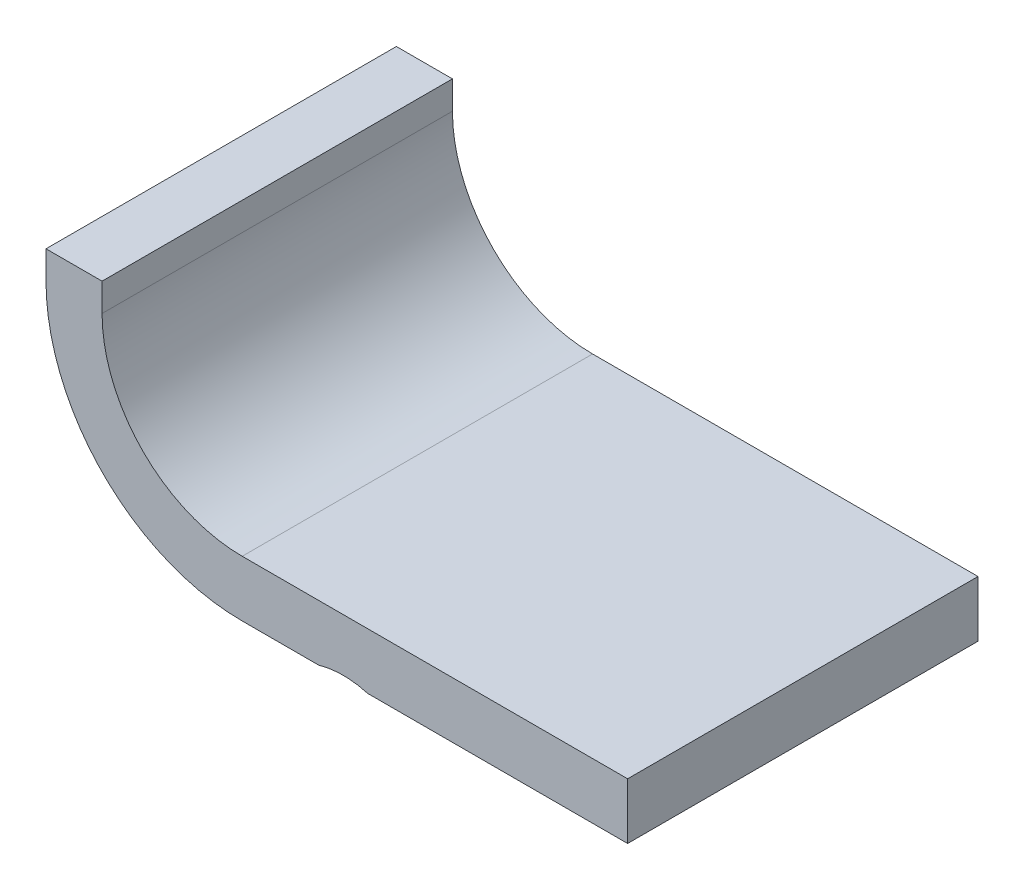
ISO-10303-21;
HEADER;
FILE_DESCRIPTION(('STEP AP214'),'2;1');
FILE_NAME('part.step','',(''),(''),'','','');
FILE_SCHEMA(('AUTOMOTIVE_DESIGN { 1 0 10303 214 1 1 1 1 }'));
ENDSEC;
DATA;
#1=APPLICATION_CONTEXT('core data for automotive mechanical design processes');
#2=APPLICATION_PROTOCOL_DEFINITION('international standard','automotive_design',2000,#1);
#3=PRODUCT_CONTEXT('',#1,'mechanical');
#4=PRODUCT('Part','Part','',(#3));
#5=PRODUCT_RELATED_PRODUCT_CATEGORY('part','',(#4));
#6=PRODUCT_DEFINITION_FORMATION('','',#4);
#7=PRODUCT_DEFINITION_CONTEXT('part definition',#1,'design');
#8=PRODUCT_DEFINITION('design','',#6,#7);
#9=PRODUCT_DEFINITION_SHAPE('','',#8);
#10=(LENGTH_UNIT() NAMED_UNIT(*) SI_UNIT(.MILLI.,.METRE.));
#11=(NAMED_UNIT(*) PLANE_ANGLE_UNIT() SI_UNIT($,.RADIAN.));
#12=(NAMED_UNIT(*) SI_UNIT($,.STERADIAN.) SOLID_ANGLE_UNIT());
#13=UNCERTAINTY_MEASURE_WITH_UNIT(LENGTH_MEASURE(1.E-05),#10,'distance_accuracy_value','');
#14=(GEOMETRIC_REPRESENTATION_CONTEXT(3) GLOBAL_UNCERTAINTY_ASSIGNED_CONTEXT((#13)) GLOBAL_UNIT_ASSIGNED_CONTEXT((#10,
#11,#12)) REPRESENTATION_CONTEXT('',''));
#15=CARTESIAN_POINT('',(0.,0.,0.));
#16=DIRECTION('',(0.,0.,1.));
#17=DIRECTION('',(1.,0.,0.));
#18=AXIS2_PLACEMENT_3D('',#15,#16,#17);
#19=CARTESIAN_POINT('',(0.,0.,50.));
#20=DIRECTION('',(0.,1.,0.));
#21=DIRECTION('',(-1.,0.,0.));
#22=AXIS2_PLACEMENT_3D('',#19,#20,#21);
#23=PLANE('',#22);
#24=DIRECTION('',(1.,0.,0.));
#25=VECTOR('',#24,1.);
#26=CARTESIAN_POINT('',(0.,0.,50.));
#27=LINE('',#26,#25);
#28=CARTESIAN_POINT('',(-37.1,0.,50.));
#29=VERTEX_POINT('',#28);
#30=CARTESIAN_POINT('',(0.,0.,50.));
#31=VERTEX_POINT('',#30);
#32=EDGE_CURVE('E54',#29,#31,#27,.T.);
#33=ORIENTED_EDGE('',*,*,#32,.F.);
#34=DIRECTION('',(0.,0.,-1.));
#35=VECTOR('',#34,1.);
#36=CARTESIAN_POINT('',(-37.1,0.,50.));
#37=LINE('',#36,#35);
#38=CARTESIAN_POINT('',(-37.1,0.,0.));
#39=VERTEX_POINT('',#38);
#40=EDGE_CURVE('E110',#29,#39,#37,.T.);
#41=ORIENTED_EDGE('',*,*,#40,.T.);
#42=DIRECTION('',(1.,0.,0.));
#43=VECTOR('',#42,1.);
#44=CARTESIAN_POINT('',(0.,0.,0.));
#45=LINE('',#44,#43);
#46=CARTESIAN_POINT('',(0.,0.,0.));
#47=VERTEX_POINT('',#46);
#48=EDGE_CURVE('E176',#39,#47,#45,.T.);
#49=ORIENTED_EDGE('',*,*,#48,.T.);
#50=DIRECTION('',(0.,0.,-1.));
#51=VECTOR('',#50,1.);
#52=CARTESIAN_POINT('',(0.,0.,50.));
#53=LINE('',#52,#51);
#54=EDGE_CURVE('E127',#31,#47,#53,.T.);
#55=ORIENTED_EDGE('',*,*,#54,.F.);
#56=EDGE_LOOP('',(#33,#41,#49,#55));
#57=FACE_BOUND('',#56,.T.);
#58=ADVANCED_FACE('F31',(#57),#23,.F.);
#59=CARTESIAN_POINT('',(0.,8.,50.));
#60=DIRECTION('',(-1.,0.,0.));
#61=DIRECTION('',(0.,0.,1.));
#62=AXIS2_PLACEMENT_3D('',#59,#60,#61);
#63=PLANE('',#62);
#64=DIRECTION('',(0.,1.,0.));
#65=VECTOR('',#64,1.);
#66=CARTESIAN_POINT('',(0.,8.,0.));
#67=LINE('',#66,#65);
#68=CARTESIAN_POINT('',(0.,8.,0.));
#69=VERTEX_POINT('',#68);
#70=EDGE_CURVE('E167',#47,#69,#67,.T.);
#71=ORIENTED_EDGE('',*,*,#70,.T.);
#72=DIRECTION('',(0.,0.,-1.));
#73=VECTOR('',#72,1.);
#74=CARTESIAN_POINT('',(0.,8.,50.));
#75=LINE('',#74,#73);
#76=CARTESIAN_POINT('',(0.,8.,50.));
#77=VERTEX_POINT('',#76);
#78=EDGE_CURVE('E11',#77,#69,#75,.T.);
#79=ORIENTED_EDGE('',*,*,#78,.F.);
#80=DIRECTION('',(0.,1.,0.));
#81=VECTOR('',#80,1.);
#82=CARTESIAN_POINT('',(0.,8.,50.));
#83=LINE('',#82,#81);
#84=EDGE_CURVE('E178',#31,#77,#83,.T.);
#85=ORIENTED_EDGE('',*,*,#84,.F.);
#86=ORIENTED_EDGE('',*,*,#54,.T.);
#87=EDGE_LOOP('',(#71,#79,#85,#86));
#88=FACE_BOUND('',#87,.T.);
#89=ADVANCED_FACE('F33',(#88),#63,.F.);
#90=CARTESIAN_POINT('',(0.,8.,50.));
#91=DIRECTION('',(0.,-1.,0.));
#92=DIRECTION('',(0.,0.,-1.));
#93=AXIS2_PLACEMENT_3D('',#90,#91,#92);
#94=PLANE('',#93);
#95=DIRECTION('',(-1.,0.,0.));
#96=VECTOR('',#95,1.);
#97=CARTESIAN_POINT('',(0.,8.,0.));
#98=LINE('',#97,#96);
#99=CARTESIAN_POINT('',(-55.,8.,0.));
#100=VERTEX_POINT('',#99);
#101=EDGE_CURVE('E161',#69,#100,#98,.T.);
#102=ORIENTED_EDGE('',*,*,#101,.T.);
#103=DIRECTION('',(0.,0.,-1.));
#104=VECTOR('',#103,1.);
#105=CARTESIAN_POINT('',(-55.,8.,50.));
#106=LINE('',#105,#104);
#107=CARTESIAN_POINT('',(-55.,8.,50.));
#108=VERTEX_POINT('',#107);
#109=EDGE_CURVE('E39',#108,#100,#106,.T.);
#110=ORIENTED_EDGE('',*,*,#109,.F.);
#111=DIRECTION('',(-1.,0.,0.));
#112=VECTOR('',#111,1.);
#113=CARTESIAN_POINT('',(0.,8.,50.));
#114=LINE('',#113,#112);
#115=EDGE_CURVE('E180',#77,#108,#114,.T.);
#116=ORIENTED_EDGE('',*,*,#115,.F.);
#117=ORIENTED_EDGE('',*,*,#78,.T.);
#118=EDGE_LOOP('',(#102,#110,#116,#117));
#119=FACE_BOUND('',#118,.T.);
#120=ADVANCED_FACE('F210',(#119),#94,.F.);
#121=CARTESIAN_POINT('',(-55.,28.,50.));
#122=DIRECTION('',(0.,0.,-1.));
#123=DIRECTION('',(-1.,0.,0.));
#124=AXIS2_PLACEMENT_3D('',#121,#122,#123);
#125=CYLINDRICAL_SURFACE('',#124,20.);
#126=CARTESIAN_POINT('',(-55.,28.,0.));
#127=DIRECTION('',(0.,0.,-1.));
#128=DIRECTION('',(-1.,0.,0.));
#129=AXIS2_PLACEMENT_3D('',#126,#127,#128);
#130=CIRCLE('',#129,20.);
#131=CARTESIAN_POINT('',(-75.,28.,0.));
#132=VERTEX_POINT('',#131);
#133=EDGE_CURVE('E154',#100,#132,#130,.T.);
#134=ORIENTED_EDGE('',*,*,#133,.T.);
#135=DIRECTION('',(0.,0.,-1.));
#136=VECTOR('',#135,1.);
#137=CARTESIAN_POINT('',(-75.,28.,50.));
#138=LINE('',#137,#136);
#139=CARTESIAN_POINT('',(-75.,28.,50.));
#140=VERTEX_POINT('',#139);
#141=EDGE_CURVE('E145',#140,#132,#138,.T.);
#142=ORIENTED_EDGE('',*,*,#141,.F.);
#143=CARTESIAN_POINT('',(-55.,28.,50.));
#144=DIRECTION('',(0.,0.,-1.));
#145=DIRECTION('',(-1.,0.,0.));
#146=AXIS2_PLACEMENT_3D('',#143,#144,#145);
#147=CIRCLE('',#146,20.);
#148=EDGE_CURVE('E155',#108,#140,#147,.T.);
#149=ORIENTED_EDGE('',*,*,#148,.F.);
#150=ORIENTED_EDGE('',*,*,#109,.T.);
#151=EDGE_LOOP('',(#134,#142,#149,#150));
#152=FACE_BOUND('',#151,.T.);
#153=ADVANCED_FACE('F152',(#152),#125,.F.);
#154=CARTESIAN_POINT('',(-75.,28.,50.));
#155=DIRECTION('',(-1.,0.,0.));
#156=DIRECTION('',(0.,-1.,0.));
#157=AXIS2_PLACEMENT_3D('',#154,#155,#156);
#158=PLANE('',#157);
#159=DIRECTION('',(0.,1.,0.));
#160=VECTOR('',#159,1.);
#161=CARTESIAN_POINT('',(-75.,28.,0.));
#162=LINE('',#161,#160);
#163=CARTESIAN_POINT('',(-75.,32.,0.));
#164=VERTEX_POINT('',#163);
#165=EDGE_CURVE('E163',#132,#164,#162,.T.);
#166=ORIENTED_EDGE('',*,*,#165,.T.);
#167=DIRECTION('',(0.,0.,-1.));
#168=VECTOR('',#167,1.);
#169=CARTESIAN_POINT('',(-75.,32.,50.));
#170=LINE('',#169,#168);
#171=CARTESIAN_POINT('',(-75.,32.,50.));
#172=VERTEX_POINT('',#171);
#173=EDGE_CURVE('E142',#172,#164,#170,.T.);
#174=ORIENTED_EDGE('',*,*,#173,.F.);
#175=DIRECTION('',(0.,1.,0.));
#176=VECTOR('',#175,1.);
#177=CARTESIAN_POINT('',(-75.,28.,50.));
#178=LINE('',#177,#176);
#179=EDGE_CURVE('E183',#140,#172,#178,.T.);
#180=ORIENTED_EDGE('',*,*,#179,.F.);
#181=ORIENTED_EDGE('',*,*,#141,.T.);
#182=EDGE_LOOP('',(#166,#174,#180,#181));
#183=FACE_BOUND('',#182,.T.);
#184=ADVANCED_FACE('F226',(#183),#158,.F.);
#185=CARTESIAN_POINT('',(-83.,32.,50.));
#186=DIRECTION('',(0.,-1.,0.));
#187=DIRECTION('',(0.,0.,-1.));
#188=AXIS2_PLACEMENT_3D('',#185,#186,#187);
#189=PLANE('',#188);
#190=DIRECTION('',(-1.,0.,0.));
#191=VECTOR('',#190,1.);
#192=CARTESIAN_POINT('',(-83.,32.,0.));
#193=LINE('',#192,#191);
#194=CARTESIAN_POINT('',(-83.,32.,0.));
#195=VERTEX_POINT('',#194);
#196=EDGE_CURVE('E165',#164,#195,#193,.T.);
#197=ORIENTED_EDGE('',*,*,#196,.T.);
#198=DIRECTION('',(0.,0.,-1.));
#199=VECTOR('',#198,1.);
#200=CARTESIAN_POINT('',(-83.,32.,50.));
#201=LINE('',#200,#199);
#202=CARTESIAN_POINT('',(-83.,32.,50.));
#203=VERTEX_POINT('',#202);
#204=EDGE_CURVE('E139',#203,#195,#201,.T.);
#205=ORIENTED_EDGE('',*,*,#204,.F.);
#206=DIRECTION('',(-1.,0.,0.));
#207=VECTOR('',#206,1.);
#208=CARTESIAN_POINT('',(-83.,32.,50.));
#209=LINE('',#208,#207);
#210=EDGE_CURVE('E185',#172,#203,#209,.T.);
#211=ORIENTED_EDGE('',*,*,#210,.F.);
#212=ORIENTED_EDGE('',*,*,#173,.T.);
#213=EDGE_LOOP('',(#197,#205,#211,#212));
#214=FACE_BOUND('',#213,.T.);
#215=ADVANCED_FACE('F221',(#214),#189,.F.);
#216=CARTESIAN_POINT('',(-83.,28.,50.));
#217=DIRECTION('',(1.,0.,0.));
#218=DIRECTION('',(0.,0.,-1.));
#219=AXIS2_PLACEMENT_3D('',#216,#217,#218);
#220=PLANE('',#219);
#221=DIRECTION('',(0.,-1.,0.));
#222=VECTOR('',#221,1.);
#223=CARTESIAN_POINT('',(-83.,28.,0.));
#224=LINE('',#223,#222);
#225=CARTESIAN_POINT('',(-83.,28.,0.));
#226=VERTEX_POINT('',#225);
#227=EDGE_CURVE('E172',#195,#226,#224,.T.);
#228=ORIENTED_EDGE('',*,*,#227,.T.);
#229=DIRECTION('',(0.,0.,-1.));
#230=VECTOR('',#229,1.);
#231=CARTESIAN_POINT('',(-83.,28.,50.));
#232=LINE('',#231,#230);
#233=CARTESIAN_POINT('',(-83.,28.,50.));
#234=VERTEX_POINT('',#233);
#235=EDGE_CURVE('E136',#234,#226,#232,.T.);
#236=ORIENTED_EDGE('',*,*,#235,.F.);
#237=DIRECTION('',(0.,-1.,0.));
#238=VECTOR('',#237,1.);
#239=CARTESIAN_POINT('',(-83.,28.,50.));
#240=LINE('',#239,#238);
#241=EDGE_CURVE('E186',#203,#234,#240,.T.);
#242=ORIENTED_EDGE('',*,*,#241,.F.);
#243=ORIENTED_EDGE('',*,*,#204,.T.);
#244=EDGE_LOOP('',(#228,#236,#242,#243));
#245=FACE_BOUND('',#244,.T.);
#246=ADVANCED_FACE('F192',(#245),#220,.F.);
#247=CARTESIAN_POINT('',(-55.,28.,50.));
#248=DIRECTION('',(0.,0.,-1.));
#249=DIRECTION('',(-1.,0.,0.));
#250=AXIS2_PLACEMENT_3D('',#247,#248,#249);
#251=CYLINDRICAL_SURFACE('',#250,28.);
#252=CARTESIAN_POINT('',(-55.,28.,0.));
#253=DIRECTION('',(0.,0.,1.));
#254=DIRECTION('',(-1.,0.,0.));
#255=AXIS2_PLACEMENT_3D('',#252,#253,#254);
#256=CIRCLE('',#255,28.);
#257=CARTESIAN_POINT('',(-55.,0.,0.));
#258=VERTEX_POINT('',#257);
#259=EDGE_CURVE('E174',#226,#258,#256,.T.);
#260=ORIENTED_EDGE('',*,*,#259,.T.);
#261=DIRECTION('',(0.,0.,-1.));
#262=VECTOR('',#261,1.);
#263=CARTESIAN_POINT('',(-55.,0.,50.));
#264=LINE('',#263,#262);
#265=CARTESIAN_POINT('',(-55.,0.,50.));
#266=VERTEX_POINT('',#265);
#267=EDGE_CURVE('E130',#266,#258,#264,.T.);
#268=ORIENTED_EDGE('',*,*,#267,.F.);
#269=CARTESIAN_POINT('',(-55.,28.,50.));
#270=DIRECTION('',(0.,0.,1.));
#271=DIRECTION('',(-1.,0.,0.));
#272=AXIS2_PLACEMENT_3D('',#269,#270,#271);
#273=CIRCLE('',#272,28.);
#274=EDGE_CURVE('E125',#234,#266,#273,.T.);
#275=ORIENTED_EDGE('',*,*,#274,.F.);
#276=ORIENTED_EDGE('',*,*,#235,.T.);
#277=EDGE_LOOP('',(#260,#268,#275,#276));
#278=FACE_BOUND('',#277,.T.);
#279=ADVANCED_FACE('F196',(#278),#251,.T.);
#280=CARTESIAN_POINT('',(-44.1,0.,0.));
#281=VERTEX_POINT('',#280);
#282=EDGE_CURVE('E121',#258,#281,#45,.T.);
#283=ORIENTED_EDGE('',*,*,#282,.T.);
#284=DIRECTION('',(0.,0.,-1.));
#285=VECTOR('',#284,1.);
#286=CARTESIAN_POINT('',(-44.1,0.,50.));
#287=LINE('',#286,#285);
#288=CARTESIAN_POINT('',(-44.1,0.,50.));
#289=VERTEX_POINT('',#288);
#290=EDGE_CURVE('E46',#281,#289,#287,.F.);
#291=ORIENTED_EDGE('',*,*,#290,.T.);
#292=EDGE_CURVE('E119',#266,#289,#27,.T.);
#293=ORIENTED_EDGE('',*,*,#292,.F.);
#294=ORIENTED_EDGE('',*,*,#267,.T.);
#295=EDGE_LOOP('',(#283,#291,#293,#294));
#296=FACE_BOUND('',#295,.T.);
#297=ADVANCED_FACE('F117',(#296),#23,.F.);
#298=CARTESIAN_POINT('',(-55.,28.,50.));
#299=DIRECTION('',(0.,0.,-1.));
#300=DIRECTION('',(-1.,0.,0.));
#301=AXIS2_PLACEMENT_3D('',#298,#299,#300);
#302=PLANE('',#301);
#303=ORIENTED_EDGE('',*,*,#292,.T.);
#304=CARTESIAN_POINT('',(-40.6,-12.,50.));
#305=DIRECTION('',(0.,0.,-1.));
#306=DIRECTION('',(-1.,0.,0.));
#307=AXIS2_PLACEMENT_3D('',#304,#305,#306);
#308=CIRCLE('',#307,12.5);
#309=EDGE_CURVE('E107',#289,#29,#308,.T.);
#310=ORIENTED_EDGE('',*,*,#309,.T.);
#311=ORIENTED_EDGE('',*,*,#32,.T.);
#312=ORIENTED_EDGE('',*,*,#84,.T.);
#313=ORIENTED_EDGE('',*,*,#115,.T.);
#314=ORIENTED_EDGE('',*,*,#148,.T.);
#315=ORIENTED_EDGE('',*,*,#179,.T.);
#316=ORIENTED_EDGE('',*,*,#210,.T.);
#317=ORIENTED_EDGE('',*,*,#241,.T.);
#318=ORIENTED_EDGE('',*,*,#274,.T.);
#319=EDGE_LOOP('',(#303,#310,#311,#312,#313,#314,#315,#316,#317,#318));
#320=FACE_BOUND('',#319,.T.);
#321=ADVANCED_FACE('F123',(#320),#302,.F.);
#322=CARTESIAN_POINT('',(-55.,28.,0.));
#323=DIRECTION('',(0.,0.,-1.));
#324=DIRECTION('',(-1.,0.,0.));
#325=AXIS2_PLACEMENT_3D('',#322,#323,#324);
#326=PLANE('',#325);
#327=CARTESIAN_POINT('',(-40.6,-12.,0.));
#328=DIRECTION('',(0.,0.,-1.));
#329=DIRECTION('',(-1.,0.,0.));
#330=AXIS2_PLACEMENT_3D('',#327,#328,#329);
#331=CIRCLE('',#330,12.5);
#332=EDGE_CURVE('E112',#281,#39,#331,.T.);
#333=ORIENTED_EDGE('',*,*,#332,.F.);
#334=ORIENTED_EDGE('',*,*,#282,.F.);
#335=ORIENTED_EDGE('',*,*,#259,.F.);
#336=ORIENTED_EDGE('',*,*,#227,.F.);
#337=ORIENTED_EDGE('',*,*,#196,.F.);
#338=ORIENTED_EDGE('',*,*,#165,.F.);
#339=ORIENTED_EDGE('',*,*,#133,.F.);
#340=ORIENTED_EDGE('',*,*,#101,.F.);
#341=ORIENTED_EDGE('',*,*,#70,.F.);
#342=ORIENTED_EDGE('',*,*,#48,.F.);
#343=EDGE_LOOP('',(#333,#334,#335,#336,#337,#338,#339,#340,#341,#342));
#344=FACE_BOUND('',#343,.T.);
#345=ADVANCED_FACE('F159',(#344),#326,.T.);
#346=CARTESIAN_POINT('',(-40.6,-12.,50.));
#347=DIRECTION('',(0.,0.,-1.));
#348=DIRECTION('',(-1.,0.,0.));
#349=AXIS2_PLACEMENT_3D('',#346,#347,#348);
#350=CYLINDRICAL_SURFACE('',#349,12.5);
#351=ORIENTED_EDGE('',*,*,#309,.F.);
#352=ORIENTED_EDGE('',*,*,#290,.F.);
#353=ORIENTED_EDGE('',*,*,#332,.T.);
#354=ORIENTED_EDGE('',*,*,#40,.F.);
#355=EDGE_LOOP('',(#351,#352,#353,#354));
#356=FACE_BOUND('',#355,.T.);
#357=ADVANCED_FACE('F108',(#356),#350,.F.);
#358=CLOSED_SHELL('',(#58,#89,#120,#153,#184,#215,#246,#279,#297,#321,#345,#357));
#359=MANIFOLD_SOLID_BREP('B2',#358);
#360=ADVANCED_BREP_SHAPE_REPRESENTATION('',(#18,#359),#14);
#361=SHAPE_DEFINITION_REPRESENTATION(#9,#360);
ENDSEC;
END-ISO-10303-21;
